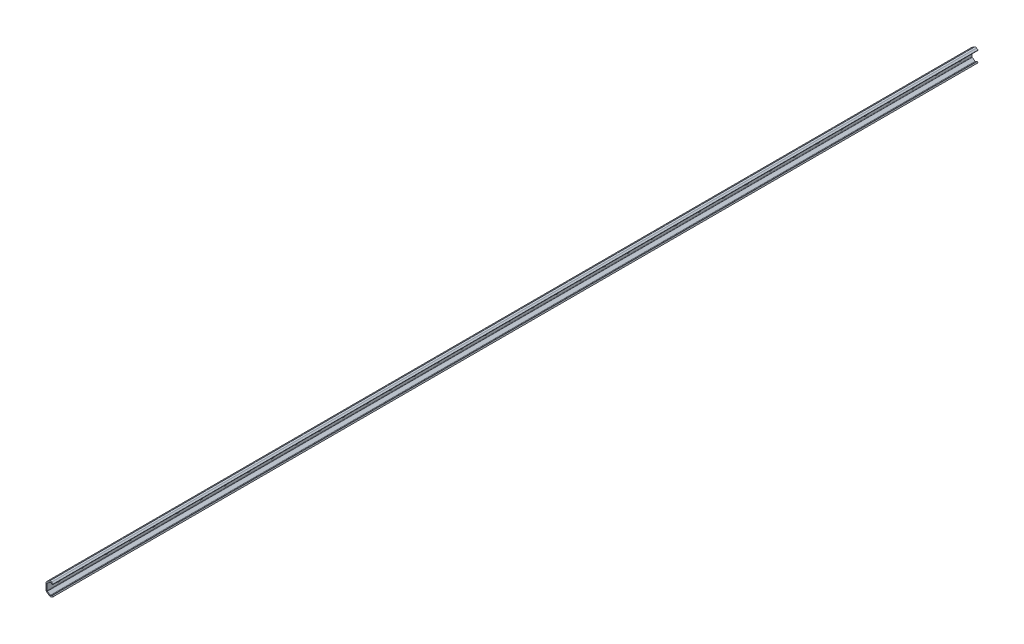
from build123d import *

# Parameters (mm, degrees)
EXTRUDE1_DEPTH  = 3120
EXTRUDE2_DEPTH  = 3121.150868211
LPATTERN1_COUNT = 39
LPATTERN1_PITCH = 80


with BuildPart() as part:
    # Sketch1 → Extrude1 (new body)
    with BuildSketch(Plane.XY):
        with BuildLine():
            Line((21.705694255, -15.401627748), (24, -18.678235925))
            Line((24, -18.678235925), (19.036236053, -22.153900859))
            ThreePointArc((19.036236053, -22.153900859), (15.5, -23.268871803), (11.963763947, -22.153900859))
            Line((11.963763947, -22.153900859), (3.371852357, -16.137779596))
            ThreePointArc((3.371852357, -16.137779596), (0.906121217, -13.750365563), (0, -10.44))
            Line((0, -10.44), (0, 10.44))
            ThreePointArc((0, 10.44), (0.906121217, 13.750365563), (3.371852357, 16.137779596))
            Line((3.371852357, 16.137779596), (11.963763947, 22.153900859))
            ThreePointArc((11.963763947, 22.153900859), (15.5, 23.268871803), (19.036236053, 22.153900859))
            Line((19.036236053, 22.153900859), (24, 18.678235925))
            Line((24, 18.678235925), (21.705694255, 15.401627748))
            Line((21.705694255, 15.401627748), (16.813992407, 18.826834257))
            ThreePointArc((16.813992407, 18.826834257), (15.5, 19.241134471), (14.186007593, 18.826834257))
            Line((14.186007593, 18.826834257), (4.730448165, 12.205980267))
            ThreePointArc((4.730448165, 12.205980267), (4.107613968, 11.429543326), (4, 10.44))
            Line((4, 10.44), (4, -10.44))
            ThreePointArc((4, -10.44), (4.189818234, -11.395541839), (4.730448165, -12.205980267))
            Line((4.730448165, -12.205980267), (14.186007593, -18.826834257))
            ThreePointArc((14.186007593, -18.826834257), (15.5, -19.241134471), (16.813992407, -18.826834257))
            Line((16.813992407, -18.826834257), (21.705694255, -15.401627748))
        make_face()
    extrude(amount=-EXTRUDE1_DEPTH)

    # Sketch2 → Extrude2 (cut, through all)
    with BuildSketch(Plane(origin=(4, 0, 0), x_dir=(0, 0, -1), z_dir=(1, 0, 0))):
        with BuildLine():
            Line((39, 4.5), (41, 4.5))
            ThreePointArc((41, 4.5), (45.5, 0), (41, -4.5))
            Line((41, -4.5), (39, -4.5))
            ThreePointArc((39, -4.5), (34.5, 0), (39, 4.5))
        make_face()
    extrude2 = extrude(amount=-EXTRUDE2_DEPTH, mode=Mode.SUBTRACT)

    # LPattern1: Extrude2 ×39
    with Locations(*[(0, 0, -i * LPATTERN1_PITCH) for i in range(1, LPATTERN1_COUNT)]):
        add(extrude2, mode=Mode.SUBTRACT)


solid = part.part
